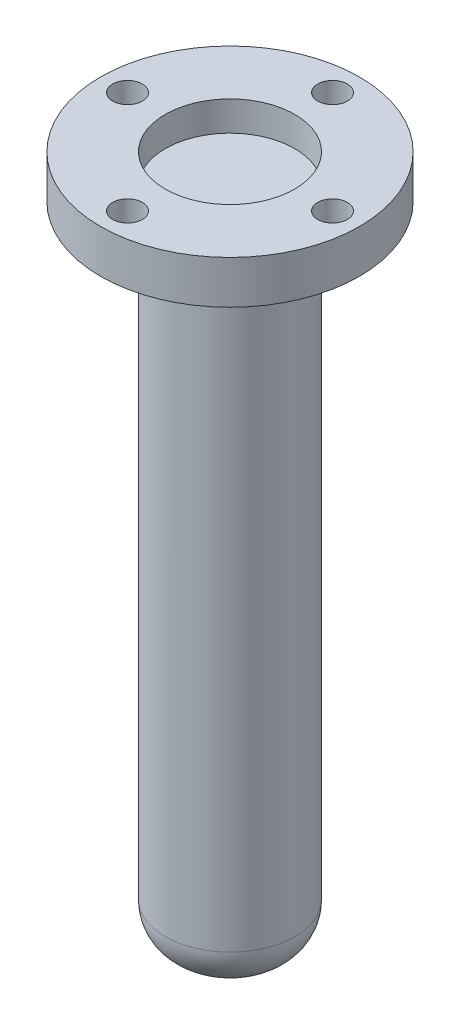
from build123d import *

# Parameters (mm, degrees)
SKETCH1_R           = 24
BOSS_EXTRUDE1_DEPTH = 8
SKETCH11_W          = 12
SKETCH11_H          = 120
FILLET1_R           = 8
SKETCH12_R          = 12
SKETCH12_R_2        = 2.75
CUT_EXTRUDE1_DEPTH  = 5.5


with BuildPart() as part:
    # Sketch1 → Boss-Extrude1 (new body)
    with BuildSketch(Plane(origin=(0, 0, 0), x_dir=(1, 0, 0), z_dir=(0, 1, 0))):
        with Locations(Location((0, 0, 0), (0, 0, 270))):
            Circle(SKETCH1_R)
    extrude(amount=BOSS_EXTRUDE1_DEPTH)

    # Sketch11 → Revolve1 (revolve)
    with BuildSketch(Plane.XY, mode=Mode.PRIVATE) as revolve1_sk:
        with Locations((6, -60)):
            Rectangle(SKETCH11_W, SKETCH11_H)
    revolve(revolve1_sk.sketch.rotate(Axis((0, 0, 0), (0, -1, 0)), 180), axis=Axis((0, 0, 0), (0, -1, 0)))

    # Fillet1
    fillet1_edges = [part.edges().sort_by_distance(p)[0] for p in [
        (12, -120, 0),
    ]]
    fillet(fillet1_edges, radius=FILLET1_R)

    # Sketch12 → Cut-Extrude1 (cut)
    with BuildSketch(Plane(origin=(0, 8, 0), x_dir=(1, 0, 0), z_dir=(0, 1, 0))):
        with Locations(Location((0, 0, 0), (0, 0, 180))):
            Circle(SKETCH12_R)
        with Locations(Location((19, 0, 0), (0, 0, 270))):
            Circle(SKETCH12_R_2)
        with Locations(Location((0, -19, 0), (0, 0, 270))):
            Circle(SKETCH12_R_2)
        with Locations(Location((-19, 0, 0), (0, 0, 270))):
            Circle(SKETCH12_R_2)
        with Locations(Location((0, 19, 0), (0, 0, 270))):
            Circle(SKETCH12_R_2)
    extrude(amount=-CUT_EXTRUDE1_DEPTH, mode=Mode.SUBTRACT)


solid = part.part
